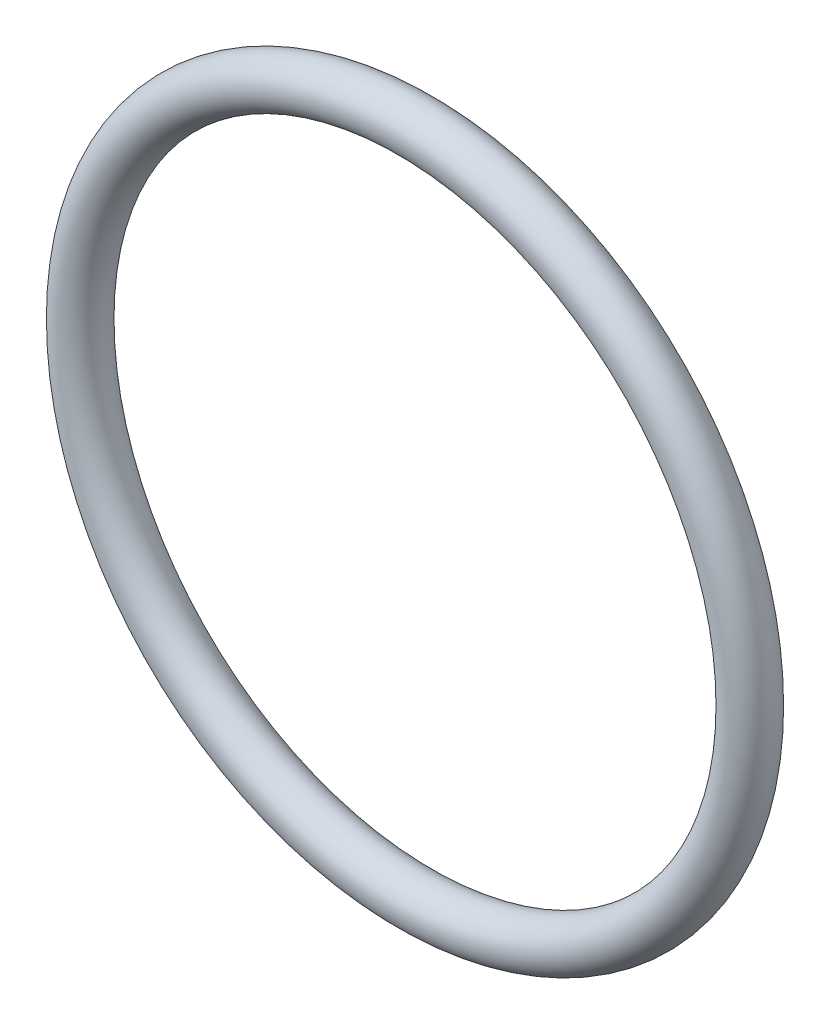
from build123d import *

# Parameters (mm, degrees)
SKIZZE1_R = 1


with BuildPart() as part:
    # Skizze1 → Rotation1 (revolve)
    with BuildSketch(Plane(origin=(0, 0, 0), x_dir=(0, 0, -1), z_dir=(1, 0, 0)), mode=Mode.PRIVATE) as rotation1_sk:
        with Locations((0, 14)):
            Circle(SKIZZE1_R)
    revolve(rotation1_sk.sketch.rotate(Axis((0, 0, 0), (0, 0, -1)), 90), axis=Axis((0, 0, 0), (0, 0, -1)))


solid = part.part
